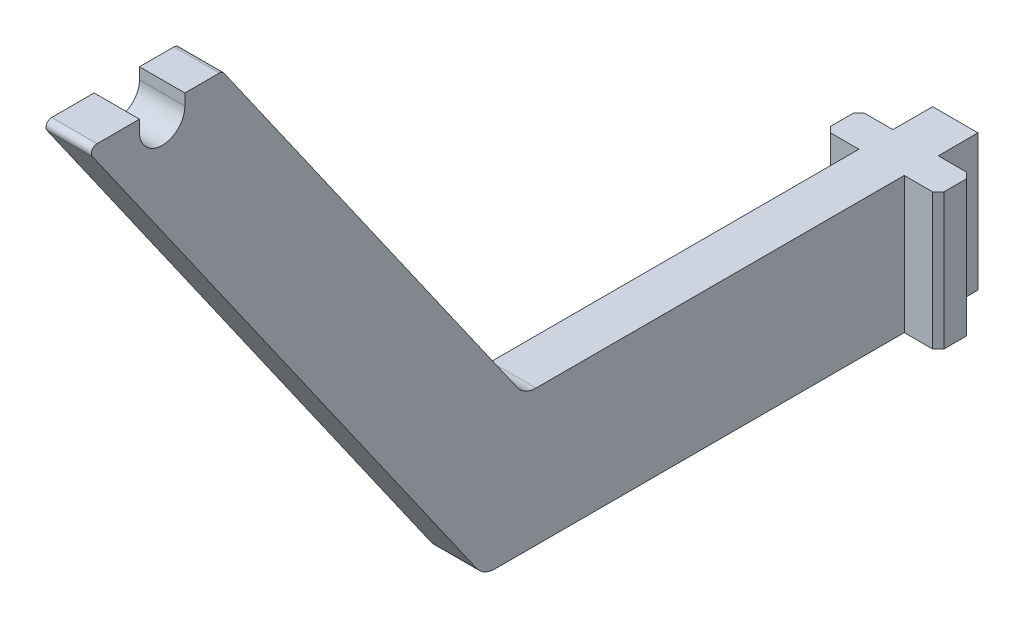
ISO-10303-21;
HEADER;
FILE_DESCRIPTION(('STEP AP214'),'2;1');
FILE_NAME('part.step','',(''),(''),'','','');
FILE_SCHEMA(('AUTOMOTIVE_DESIGN { 1 0 10303 214 1 1 1 1 }'));
ENDSEC;
DATA;
#1=APPLICATION_CONTEXT('core data for automotive mechanical design processes');
#2=APPLICATION_PROTOCOL_DEFINITION('international standard','automotive_design',2000,#1);
#3=PRODUCT_CONTEXT('',#1,'mechanical');
#4=PRODUCT('Part','Part','',(#3));
#5=PRODUCT_RELATED_PRODUCT_CATEGORY('part','',(#4));
#6=PRODUCT_DEFINITION_FORMATION('','',#4);
#7=PRODUCT_DEFINITION_CONTEXT('part definition',#1,'design');
#8=PRODUCT_DEFINITION('design','',#6,#7);
#9=PRODUCT_DEFINITION_SHAPE('','',#8);
#10=(LENGTH_UNIT() NAMED_UNIT(*) SI_UNIT(.MILLI.,.METRE.));
#11=(NAMED_UNIT(*) PLANE_ANGLE_UNIT() SI_UNIT($,.RADIAN.));
#12=(NAMED_UNIT(*) SI_UNIT($,.STERADIAN.) SOLID_ANGLE_UNIT());
#13=UNCERTAINTY_MEASURE_WITH_UNIT(LENGTH_MEASURE(1.E-05),#10,'distance_accuracy_value','');
#14=(GEOMETRIC_REPRESENTATION_CONTEXT(3) GLOBAL_UNCERTAINTY_ASSIGNED_CONTEXT((#13)) GLOBAL_UNIT_ASSIGNED_CONTEXT((#10,
#11,#12)) REPRESENTATION_CONTEXT('',''));
#15=CARTESIAN_POINT('',(0.,0.,0.));
#16=DIRECTION('',(0.,0.,1.));
#17=DIRECTION('',(1.,0.,0.));
#18=AXIS2_PLACEMENT_3D('',#15,#16,#17);
#19=CARTESIAN_POINT('',(1.,25.,39.3039432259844));
#20=DIRECTION('',(0.,-1.,0.));
#21=DIRECTION('',(0.,0.,-1.));
#22=AXIS2_PLACEMENT_3D('',#19,#20,#21);
#23=PLANE('',#22);
#24=DIRECTION('',(0.,0.,1.));
#25=VECTOR('',#24,1.);
#26=CARTESIAN_POINT('',(-1.,25.,39.3039432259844));
#27=LINE('',#26,#25);
#28=CARTESIAN_POINT('',(-1.,25.,36.9538394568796));
#29=VERTEX_POINT('',#28);
#30=CARTESIAN_POINT('',(-1.,25.,38.8236976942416));
#31=VERTEX_POINT('',#30);
#32=EDGE_CURVE('E223',#29,#31,#27,.T.);
#33=ORIENTED_EDGE('',*,*,#32,.T.);
#34=DIRECTION('',(-1.,0.,0.));
#35=VECTOR('',#34,1.);
#36=CARTESIAN_POINT('',(1.,25.,38.8236976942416));
#37=LINE('',#36,#35);
#38=CARTESIAN_POINT('',(1.,25.,38.8236976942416));
#39=VERTEX_POINT('',#38);
#40=EDGE_CURVE('E312',#31,#39,#37,.F.);
#41=ORIENTED_EDGE('',*,*,#40,.T.);
#42=DIRECTION('',(0.,0.,1.));
#43=VECTOR('',#42,1.);
#44=CARTESIAN_POINT('',(1.,25.,39.3039432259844));
#45=LINE('',#44,#43);
#46=CARTESIAN_POINT('',(1.,25.,36.9538394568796));
#47=VERTEX_POINT('',#46);
#48=EDGE_CURVE('E226',#47,#39,#45,.T.);
#49=ORIENTED_EDGE('',*,*,#48,.F.);
#50=DIRECTION('',(-1.,0.,0.));
#51=VECTOR('',#50,1.);
#52=CARTESIAN_POINT('',(2.500025,25.,36.9538394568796));
#53=LINE('',#52,#51);
#54=EDGE_CURVE('E210',#47,#29,#53,.T.);
#55=ORIENTED_EDGE('',*,*,#54,.T.);
#56=EDGE_LOOP('',(#33,#41,#49,#55));
#57=FACE_BOUND('',#56,.T.);
#58=ADVANCED_FACE('F35',(#57),#23,.F.);
#59=CARTESIAN_POINT('',(1.,0.,0.));
#60=DIRECTION('',(-1.,0.,0.));
#61=DIRECTION('',(0.,0.,1.));
#62=AXIS2_PLACEMENT_3D('',#59,#60,#61);
#63=PLANE('',#62);
#64=DIRECTION('',(0.,1.,0.));
#65=VECTOR('',#64,1.);
#66=CARTESIAN_POINT('',(1.,-2.12132034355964,1.75));
#67=LINE('',#66,#65);
#68=CARTESIAN_POINT('',(1.,0.,1.75));
#69=VERTEX_POINT('',#68);
#70=CARTESIAN_POINT('',(1.,6.,1.75));
#71=VERTEX_POINT('',#70);
#72=EDGE_CURVE('E334',#69,#71,#67,.T.);
#73=ORIENTED_EDGE('',*,*,#72,.F.);
#74=DIRECTION('',(0.,0.,-1.));
#75=VECTOR('',#74,1.);
#76=CARTESIAN_POINT('',(1.,0.,0.));
#77=LINE('',#76,#75);
#78=CARTESIAN_POINT('',(1.,0.,0.));
#79=VERTEX_POINT('',#78);
#80=EDGE_CURVE('E243',#69,#79,#77,.T.);
#81=ORIENTED_EDGE('',*,*,#80,.T.);
#82=DIRECTION('',(0.,1.,0.));
#83=VECTOR('',#82,1.);
#84=CARTESIAN_POINT('',(1.,0.,0.));
#85=LINE('',#84,#83);
#86=CARTESIAN_POINT('',(1.,6.,0.));
#87=VERTEX_POINT('',#86);
#88=EDGE_CURVE('E273',#79,#87,#85,.T.);
#89=ORIENTED_EDGE('',*,*,#88,.T.);
#90=DIRECTION('',(0.,0.,1.));
#91=VECTOR('',#90,1.);
#92=CARTESIAN_POINT('',(1.,6.,0.));
#93=LINE('',#92,#91);
#94=EDGE_CURVE('E288',#87,#71,#93,.T.);
#95=ORIENTED_EDGE('',*,*,#94,.T.);
#96=EDGE_LOOP('',(#73,#81,#89,#95));
#97=FACE_BOUND('',#96,.T.);
#98=ADVANCED_FACE('F480',(#97),#63,.F.);
#99=CARTESIAN_POINT('',(-1.,0.,0.));
#100=DIRECTION('',(-1.,0.,0.));
#101=DIRECTION('',(0.,0.,1.));
#102=AXIS2_PLACEMENT_3D('',#99,#100,#101);
#103=PLANE('',#102);
#104=DIRECTION('',(0.,0.,-1.));
#105=VECTOR('',#104,1.);
#106=CARTESIAN_POINT('',(-1.,0.,0.));
#107=LINE('',#106,#105);
#108=CARTESIAN_POINT('',(-1.,0.,1.75));
#109=VERTEX_POINT('',#108);
#110=CARTESIAN_POINT('',(-1.,0.,0.));
#111=VERTEX_POINT('',#110);
#112=EDGE_CURVE('E252',#109,#111,#107,.T.);
#113=ORIENTED_EDGE('',*,*,#112,.F.);
#114=DIRECTION('',(0.,1.,0.));
#115=VECTOR('',#114,1.);
#116=CARTESIAN_POINT('',(-1.,-2.12132034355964,1.75));
#117=LINE('',#116,#115);
#118=CARTESIAN_POINT('',(-1.,6.,1.75));
#119=VERTEX_POINT('',#118);
#120=EDGE_CURVE('E404',#109,#119,#117,.T.);
#121=ORIENTED_EDGE('',*,*,#120,.T.);
#122=DIRECTION('',(0.,0.,1.));
#123=VECTOR('',#122,1.);
#124=CARTESIAN_POINT('',(-1.,6.,0.));
#125=LINE('',#124,#123);
#126=CARTESIAN_POINT('',(-1.,6.,0.));
#127=VERTEX_POINT('',#126);
#128=EDGE_CURVE('E238',#127,#119,#125,.T.);
#129=ORIENTED_EDGE('',*,*,#128,.F.);
#130=DIRECTION('',(0.,1.,0.));
#131=VECTOR('',#130,1.);
#132=CARTESIAN_POINT('',(-1.,0.,0.));
#133=LINE('',#132,#131);
#134=EDGE_CURVE('E262',#111,#127,#133,.T.);
#135=ORIENTED_EDGE('',*,*,#134,.F.);
#136=EDGE_LOOP('',(#113,#121,#129,#135));
#137=FACE_BOUND('',#136,.T.);
#138=ADVANCED_FACE('F462',(#137),#103,.T.);
#139=CARTESIAN_POINT('',(1.,0.,0.));
#140=DIRECTION('',(0.,1.,0.));
#141=DIRECTION('',(0.,0.,1.));
#142=AXIS2_PLACEMENT_3D('',#139,#140,#141);
#143=PLANE('',#142);
#144=DIRECTION('',(-1.,0.,0.));
#145=VECTOR('',#144,1.);
#146=CARTESIAN_POINT('',(-2.5,0.,3.25));
#147=LINE('',#146,#145);
#148=CARTESIAN_POINT('',(-1.,0.,3.25));
#149=VERTEX_POINT('',#148);
#150=CARTESIAN_POINT('',(-2.25000000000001,0.,3.25));
#151=VERTEX_POINT('',#150);
#152=EDGE_CURVE('E398',#149,#151,#147,.T.);
#153=ORIENTED_EDGE('',*,*,#152,.T.);
#154=DIRECTION('',(0.707106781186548,0.,0.707106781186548));
#155=VECTOR('',#154,1.);
#156=CARTESIAN_POINT('',(-2.5,0.,3.00000000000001));
#157=LINE('',#156,#155);
#158=CARTESIAN_POINT('',(-2.5,0.,3.00000000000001));
#159=VERTEX_POINT('',#158);
#160=EDGE_CURVE('E365',#151,#159,#157,.F.);
#161=ORIENTED_EDGE('',*,*,#160,.T.);
#162=DIRECTION('',(0.,0.,-1.));
#163=VECTOR('',#162,1.);
#164=CARTESIAN_POINT('',(-2.5,0.,1.75));
#165=LINE('',#164,#163);
#166=CARTESIAN_POINT('',(-2.5,0.,2.));
#167=VERTEX_POINT('',#166);
#168=EDGE_CURVE('E395',#159,#167,#165,.T.);
#169=ORIENTED_EDGE('',*,*,#168,.T.);
#170=DIRECTION('',(-0.707106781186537,0.,0.707106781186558));
#171=VECTOR('',#170,1.);
#172=CARTESIAN_POINT('',(-2.25000000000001,0.,1.75));
#173=LINE('',#172,#171);
#174=CARTESIAN_POINT('',(-2.25000000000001,0.,1.75));
#175=VERTEX_POINT('',#174);
#176=EDGE_CURVE('E363',#167,#175,#173,.F.);
#177=ORIENTED_EDGE('',*,*,#176,.T.);
#178=DIRECTION('',(1.,0.,0.));
#179=VECTOR('',#178,1.);
#180=CARTESIAN_POINT('',(-1.,0.,1.75));
#181=LINE('',#180,#179);
#182=EDGE_CURVE('E256',#175,#109,#181,.T.);
#183=ORIENTED_EDGE('',*,*,#182,.T.);
#184=ORIENTED_EDGE('',*,*,#112,.T.);
#185=DIRECTION('',(-1.,0.,0.));
#186=VECTOR('',#185,1.);
#187=CARTESIAN_POINT('',(1.,0.,0.));
#188=LINE('',#187,#186);
#189=EDGE_CURVE('E247',#79,#111,#188,.T.);
#190=ORIENTED_EDGE('',*,*,#189,.F.);
#191=ORIENTED_EDGE('',*,*,#80,.F.);
#192=DIRECTION('',(1.,0.,0.));
#193=VECTOR('',#192,1.);
#194=CARTESIAN_POINT('',(1.,0.,1.75));
#195=LINE('',#194,#193);
#196=CARTESIAN_POINT('',(2.25,0.,1.75));
#197=VERTEX_POINT('',#196);
#198=EDGE_CURVE('E342',#69,#197,#195,.T.);
#199=ORIENTED_EDGE('',*,*,#198,.T.);
#200=DIRECTION('',(-0.707106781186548,0.,-0.707106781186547));
#201=VECTOR('',#200,1.);
#202=CARTESIAN_POINT('',(2.5,0.,2.));
#203=LINE('',#202,#201);
#204=CARTESIAN_POINT('',(2.5,0.,2.));
#205=VERTEX_POINT('',#204);
#206=EDGE_CURVE('E359',#197,#205,#203,.F.);
#207=ORIENTED_EDGE('',*,*,#206,.T.);
#208=DIRECTION('',(0.,0.,1.));
#209=VECTOR('',#208,1.);
#210=CARTESIAN_POINT('',(2.5,0.,1.75));
#211=LINE('',#210,#209);
#212=CARTESIAN_POINT('',(2.5,0.,3.));
#213=VERTEX_POINT('',#212);
#214=EDGE_CURVE('E356',#205,#213,#211,.T.);
#215=ORIENTED_EDGE('',*,*,#214,.T.);
#216=DIRECTION('',(0.707106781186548,0.,-0.707106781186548));
#217=VECTOR('',#216,1.);
#218=CARTESIAN_POINT('',(2.25,0.,3.25));
#219=LINE('',#218,#217);
#220=CARTESIAN_POINT('',(2.25,0.,3.25));
#221=VERTEX_POINT('',#220);
#222=EDGE_CURVE('E50',#213,#221,#219,.F.);
#223=ORIENTED_EDGE('',*,*,#222,.T.);
#224=DIRECTION('',(-1.,0.,0.));
#225=VECTOR('',#224,1.);
#226=CARTESIAN_POINT('',(2.5,0.,3.25));
#227=LINE('',#226,#225);
#228=CARTESIAN_POINT('',(1.,0.,3.25));
#229=VERTEX_POINT('',#228);
#230=EDGE_CURVE('E345',#221,#229,#227,.T.);
#231=ORIENTED_EDGE('',*,*,#230,.T.);
#232=CARTESIAN_POINT('',(1.,0.,21.27818772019));
#233=VERTEX_POINT('',#232);
#234=EDGE_CURVE('E269',#233,#229,#77,.T.);
#235=ORIENTED_EDGE('',*,*,#234,.F.);
#236=DIRECTION('',(-1.,0.,0.));
#237=VECTOR('',#236,1.);
#238=CARTESIAN_POINT('',(1.,0.,21.27818772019));
#239=LINE('',#238,#237);
#240=CARTESIAN_POINT('',(-1.,0.,21.27818772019));
#241=VERTEX_POINT('',#240);
#242=EDGE_CURVE('E274',#233,#241,#239,.T.);
#243=ORIENTED_EDGE('',*,*,#242,.T.);
#244=EDGE_CURVE('E255',#241,#149,#107,.T.);
#245=ORIENTED_EDGE('',*,*,#244,.T.);
#246=EDGE_LOOP('',(#153,#161,#169,#177,#183,#184,#190,#191,#199,#207,#215,#223,#231,#235,#243,#245));
#247=FACE_BOUND('',#246,.T.);
#248=ADVANCED_FACE('F439',(#247),#143,.F.);
#249=CARTESIAN_POINT('',(1.,0.,0.));
#250=DIRECTION('',(0.,0.,1.));
#251=DIRECTION('',(1.,0.,0.));
#252=AXIS2_PLACEMENT_3D('',#249,#250,#251);
#253=PLANE('',#252);
#254=ORIENTED_EDGE('',*,*,#134,.T.);
#255=DIRECTION('',(-1.,0.,0.));
#256=VECTOR('',#255,1.);
#257=CARTESIAN_POINT('',(1.,6.,0.));
#258=LINE('',#257,#256);
#259=EDGE_CURVE('E244',#87,#127,#258,.T.);
#260=ORIENTED_EDGE('',*,*,#259,.F.);
#261=ORIENTED_EDGE('',*,*,#88,.F.);
#262=ORIENTED_EDGE('',*,*,#189,.T.);
#263=EDGE_LOOP('',(#254,#260,#261,#262));
#264=FACE_BOUND('',#263,.T.);
#265=ADVANCED_FACE('F456',(#264),#253,.F.);
#266=CARTESIAN_POINT('',(1.,6.,0.));
#267=DIRECTION('',(0.,-1.,0.));
#268=DIRECTION('',(0.,0.,-1.));
#269=AXIS2_PLACEMENT_3D('',#266,#267,#268);
#270=PLANE('',#269);
#271=DIRECTION('',(0.,0.,1.));
#272=VECTOR('',#271,1.);
#273=CARTESIAN_POINT('',(-2.5,6.,1.75));
#274=LINE('',#273,#272);
#275=CARTESIAN_POINT('',(-2.5,6.,2.));
#276=VERTEX_POINT('',#275);
#277=CARTESIAN_POINT('',(-2.5,6.,3.00000000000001));
#278=VERTEX_POINT('',#277);
#279=EDGE_CURVE('E400',#276,#278,#274,.T.);
#280=ORIENTED_EDGE('',*,*,#279,.T.);
#281=DIRECTION('',(-0.707106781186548,0.,-0.707106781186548));
#282=VECTOR('',#281,1.);
#283=CARTESIAN_POINT('',(-2.5,6.,3.00000000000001));
#284=LINE('',#283,#282);
#285=CARTESIAN_POINT('',(-2.25000000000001,6.,3.25));
#286=VERTEX_POINT('',#285);
#287=EDGE_CURVE('E428',#278,#286,#284,.F.);
#288=ORIENTED_EDGE('',*,*,#287,.T.);
#289=DIRECTION('',(1.,0.,0.));
#290=VECTOR('',#289,1.);
#291=CARTESIAN_POINT('',(-2.5,6.,3.25));
#292=LINE('',#291,#290);
#293=CARTESIAN_POINT('',(-1.,6.,3.25));
#294=VERTEX_POINT('',#293);
#295=EDGE_CURVE('E336',#286,#294,#292,.T.);
#296=ORIENTED_EDGE('',*,*,#295,.T.);
#297=CARTESIAN_POINT('',(-1.,6.,19.4794329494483));
#298=VERTEX_POINT('',#297);
#299=EDGE_CURVE('E405',#294,#298,#125,.T.);
#300=ORIENTED_EDGE('',*,*,#299,.T.);
#301=DIRECTION('',(-1.,0.,0.));
#302=VECTOR('',#301,1.);
#303=CARTESIAN_POINT('',(1.,6.,19.4794329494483));
#304=LINE('',#303,#302);
#305=CARTESIAN_POINT('',(1.,6.,19.4794329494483));
#306=VERTEX_POINT('',#305);
#307=EDGE_CURVE('E267',#298,#306,#304,.F.);
#308=ORIENTED_EDGE('',*,*,#307,.T.);
#309=CARTESIAN_POINT('',(1.,6.,3.25));
#310=VERTEX_POINT('',#309);
#311=EDGE_CURVE('E292',#310,#306,#93,.T.);
#312=ORIENTED_EDGE('',*,*,#311,.F.);
#313=DIRECTION('',(1.,0.,0.));
#314=VECTOR('',#313,1.);
#315=CARTESIAN_POINT('',(2.5,6.,3.25));
#316=LINE('',#315,#314);
#317=CARTESIAN_POINT('',(2.25,6.,3.25));
#318=VERTEX_POINT('',#317);
#319=EDGE_CURVE('E386',#310,#318,#316,.T.);
#320=ORIENTED_EDGE('',*,*,#319,.T.);
#321=DIRECTION('',(-0.707106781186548,0.,0.707106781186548));
#322=VECTOR('',#321,1.);
#323=CARTESIAN_POINT('',(2.25,6.,3.25));
#324=LINE('',#323,#322);
#325=CARTESIAN_POINT('',(2.5,6.,3.));
#326=VERTEX_POINT('',#325);
#327=EDGE_CURVE('E385',#318,#326,#324,.F.);
#328=ORIENTED_EDGE('',*,*,#327,.T.);
#329=DIRECTION('',(0.,0.,-1.));
#330=VECTOR('',#329,1.);
#331=CARTESIAN_POINT('',(2.5,6.,1.75));
#332=LINE('',#331,#330);
#333=CARTESIAN_POINT('',(2.5,6.,2.));
#334=VERTEX_POINT('',#333);
#335=EDGE_CURVE('E335',#326,#334,#332,.T.);
#336=ORIENTED_EDGE('',*,*,#335,.T.);
#337=DIRECTION('',(0.707106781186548,0.,0.707106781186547));
#338=VECTOR('',#337,1.);
#339=CARTESIAN_POINT('',(2.5,6.,2.));
#340=LINE('',#339,#338);
#341=CARTESIAN_POINT('',(2.25,6.,1.75));
#342=VERTEX_POINT('',#341);
#343=EDGE_CURVE('E330',#334,#342,#340,.F.);
#344=ORIENTED_EDGE('',*,*,#343,.T.);
#345=DIRECTION('',(-1.,0.,0.));
#346=VECTOR('',#345,1.);
#347=CARTESIAN_POINT('',(1.,6.,1.75));
#348=LINE('',#347,#346);
#349=EDGE_CURVE('E331',#342,#71,#348,.T.);
#350=ORIENTED_EDGE('',*,*,#349,.T.);
#351=ORIENTED_EDGE('',*,*,#94,.F.);
#352=ORIENTED_EDGE('',*,*,#259,.T.);
#353=ORIENTED_EDGE('',*,*,#128,.T.);
#354=DIRECTION('',(-1.,0.,0.));
#355=VECTOR('',#354,1.);
#356=CARTESIAN_POINT('',(-1.,6.,1.75));
#357=LINE('',#356,#355);
#358=CARTESIAN_POINT('',(-2.25000000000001,6.,1.75));
#359=VERTEX_POINT('',#358);
#360=EDGE_CURVE('E394',#119,#359,#357,.T.);
#361=ORIENTED_EDGE('',*,*,#360,.T.);
#362=DIRECTION('',(0.707106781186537,0.,-0.707106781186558));
#363=VECTOR('',#362,1.);
#364=CARTESIAN_POINT('',(-2.25000000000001,6.,1.75));
#365=LINE('',#364,#363);
#366=EDGE_CURVE('E416',#359,#276,#365,.F.);
#367=ORIENTED_EDGE('',*,*,#366,.T.);
#368=EDGE_LOOP('',(#280,#288,#296,#300,#308,#312,#320,#328,#336,#344,#350,#351,#352,#353,#361,#367));
#369=FACE_BOUND('',#368,.T.);
#370=ADVANCED_FACE('F382',(#369),#270,.F.);
#371=CARTESIAN_POINT('',(1.,6.,20.));
#372=DIRECTION('',(0.,-0.573576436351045,0.819152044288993));
#373=DIRECTION('',(0.,-0.819152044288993,-0.573576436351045));
#374=AXIS2_PLACEMENT_3D('',#371,#372,#373);
#375=PLANE('',#374);
#376=DIRECTION('',(0.,0.819152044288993,0.573576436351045));
#377=VECTOR('',#376,1.);
#378=CARTESIAN_POINT('',(-1.,6.,20.));
#379=LINE('',#378,#377);
#380=CARTESIAN_POINT('',(-1.,6.42642356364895,20.2985849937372));
#381=VERTEX_POINT('',#380);
#382=CARTESIAN_POINT('',(-1.,24.8933941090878,33.2292969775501));
#383=VERTEX_POINT('',#382);
#384=EDGE_CURVE('E234',#381,#383,#379,.T.);
#385=ORIENTED_EDGE('',*,*,#384,.T.);
#386=DIRECTION('',(-1.,0.,0.));
#387=VECTOR('',#386,1.);
#388=CARTESIAN_POINT('',(1.,24.8933941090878,33.2292969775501));
#389=LINE('',#388,#387);
#390=CARTESIAN_POINT('',(1.,24.8933941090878,33.2292969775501));
#391=VERTEX_POINT('',#390);
#392=EDGE_CURVE('E319',#383,#391,#389,.F.);
#393=ORIENTED_EDGE('',*,*,#392,.T.);
#394=DIRECTION('',(0.,0.819152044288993,0.573576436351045));
#395=VECTOR('',#394,1.);
#396=CARTESIAN_POINT('',(1.,6.,20.));
#397=LINE('',#396,#395);
#398=CARTESIAN_POINT('',(1.,6.42642356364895,20.2985849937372));
#399=VERTEX_POINT('',#398);
#400=EDGE_CURVE('E291',#399,#391,#397,.T.);
#401=ORIENTED_EDGE('',*,*,#400,.F.);
#402=DIRECTION('',(-1.,0.,0.));
#403=VECTOR('',#402,1.);
#404=CARTESIAN_POINT('',(-1.,6.42642356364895,20.2985849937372));
#405=LINE('',#404,#403);
#406=EDGE_CURVE('E251',#399,#381,#405,.T.);
#407=ORIENTED_EDGE('',*,*,#406,.T.);
#408=EDGE_LOOP('',(#385,#393,#401,#407));
#409=FACE_BOUND('',#408,.T.);
#410=ADVANCED_FACE('F497',(#409),#375,.F.);
#411=CARTESIAN_POINT('',(1.,25.,33.4340849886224));
#412=VERTEX_POINT('',#411);
#413=CARTESIAN_POINT('',(1.,25.,34.9538394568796));
#414=VERTEX_POINT('',#413);
#415=EDGE_CURVE('E298',#412,#414,#45,.T.);
#416=ORIENTED_EDGE('',*,*,#415,.F.);
#417=DIRECTION('',(-1.,0.,0.));
#418=VECTOR('',#417,1.);
#419=CARTESIAN_POINT('',(1.,25.,33.4340849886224));
#420=LINE('',#419,#418);
#421=CARTESIAN_POINT('',(-1.,25.,33.4340849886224));
#422=VERTEX_POINT('',#421);
#423=EDGE_CURVE('E315',#412,#422,#420,.T.);
#424=ORIENTED_EDGE('',*,*,#423,.T.);
#425=CARTESIAN_POINT('',(-1.,25.,34.9538394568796));
#426=VERTEX_POINT('',#425);
#427=EDGE_CURVE('E233',#422,#426,#27,.T.);
#428=ORIENTED_EDGE('',*,*,#427,.T.);
#429=DIRECTION('',(-1.,0.,0.));
#430=VECTOR('',#429,1.);
#431=CARTESIAN_POINT('',(2.500025,25.,34.9538394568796));
#432=LINE('',#431,#430);
#433=EDGE_CURVE('E227',#414,#426,#432,.T.);
#434=ORIENTED_EDGE('',*,*,#433,.F.);
#435=EDGE_LOOP('',(#416,#424,#428,#434));
#436=FACE_BOUND('',#435,.T.);
#437=ADVANCED_FACE('F517',(#436),#23,.F.);
#438=CARTESIAN_POINT('',(1.,0.,21.7987547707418));
#439=DIRECTION('',(0.,0.573576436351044,-0.819152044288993));
#440=DIRECTION('',(0.,0.819152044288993,0.573576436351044));
#441=AXIS2_PLACEMENT_3D('',#438,#439,#440);
#442=PLANE('',#441);
#443=DIRECTION('',(0.,-0.819152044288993,-0.573576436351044));
#444=VECTOR('',#443,1.);
#445=CARTESIAN_POINT('',(1.,0.,21.7987547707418));
#446=LINE('',#445,#444);
#447=CARTESIAN_POINT('',(1.,24.6066058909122,39.0284857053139));
#448=VERTEX_POINT('',#447);
#449=CARTESIAN_POINT('',(1.,0.426423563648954,22.097339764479));
#450=VERTEX_POINT('',#449);
#451=EDGE_CURVE('E248',#448,#450,#446,.T.);
#452=ORIENTED_EDGE('',*,*,#451,.F.);
#453=DIRECTION('',(-1.,0.,0.));
#454=VECTOR('',#453,1.);
#455=CARTESIAN_POINT('',(1.,24.6066058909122,39.0284857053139));
#456=LINE('',#455,#454);
#457=CARTESIAN_POINT('',(-1.,24.6066058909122,39.0284857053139));
#458=VERTEX_POINT('',#457);
#459=EDGE_CURVE('E314',#448,#458,#456,.T.);
#460=ORIENTED_EDGE('',*,*,#459,.T.);
#461=DIRECTION('',(0.,-0.819152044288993,-0.573576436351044));
#462=VECTOR('',#461,1.);
#463=CARTESIAN_POINT('',(-1.,0.,21.7987547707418));
#464=LINE('',#463,#462);
#465=CARTESIAN_POINT('',(-1.,0.426423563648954,22.097339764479));
#466=VERTEX_POINT('',#465);
#467=EDGE_CURVE('E236',#458,#466,#464,.T.);
#468=ORIENTED_EDGE('',*,*,#467,.T.);
#469=DIRECTION('',(-1.,0.,0.));
#470=VECTOR('',#469,1.);
#471=CARTESIAN_POINT('',(1.,0.426423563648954,22.097339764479));
#472=LINE('',#471,#470);
#473=EDGE_CURVE('E490',#466,#450,#472,.F.);
#474=ORIENTED_EDGE('',*,*,#473,.T.);
#475=EDGE_LOOP('',(#452,#460,#468,#474));
#476=FACE_BOUND('',#475,.T.);
#477=ADVANCED_FACE('F515',(#476),#442,.F.);
#478=ORIENTED_EDGE('',*,*,#48,.T.);
#479=CARTESIAN_POINT('',(1.,24.75,38.8236976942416));
#480=DIRECTION('',(-1.,0.,0.));
#481=DIRECTION('',(0.,0.,1.));
#482=AXIS2_PLACEMENT_3D('',#479,#480,#481);
#483=CIRCLE('',#482,0.25);
#484=EDGE_CURVE('E305',#39,#448,#483,.F.);
#485=ORIENTED_EDGE('',*,*,#484,.T.);
#486=ORIENTED_EDGE('',*,*,#451,.T.);
#487=CARTESIAN_POINT('',(1.,0.999999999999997,21.27818772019));
#488=DIRECTION('',(-1.,0.,0.));
#489=DIRECTION('',(0.,0.,1.));
#490=AXIS2_PLACEMENT_3D('',#487,#488,#489);
#491=CIRCLE('',#490,1.);
#492=EDGE_CURVE('E483',#450,#233,#491,.F.);
#493=ORIENTED_EDGE('',*,*,#492,.T.);
#494=ORIENTED_EDGE('',*,*,#234,.T.);
#495=DIRECTION('',(0.,1.,0.));
#496=VECTOR('',#495,1.);
#497=CARTESIAN_POINT('',(1.,-2.12132034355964,3.25));
#498=LINE('',#497,#496);
#499=EDGE_CURVE('E346',#229,#310,#498,.T.);
#500=ORIENTED_EDGE('',*,*,#499,.T.);
#501=ORIENTED_EDGE('',*,*,#311,.T.);
#502=CARTESIAN_POINT('',(1.,7.,19.4794329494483));
#503=DIRECTION('',(-1.,0.,0.));
#504=DIRECTION('',(0.,0.,1.));
#505=AXIS2_PLACEMENT_3D('',#502,#503,#504);
#506=CIRCLE('',#505,1.);
#507=EDGE_CURVE('E507',#306,#399,#506,.T.);
#508=ORIENTED_EDGE('',*,*,#507,.T.);
#509=ORIENTED_EDGE('',*,*,#400,.T.);
#510=CARTESIAN_POINT('',(1.,24.75,33.4340849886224));
#511=DIRECTION('',(-1.,0.,0.));
#512=DIRECTION('',(0.,0.,1.));
#513=AXIS2_PLACEMENT_3D('',#510,#511,#512);
#514=CIRCLE('',#513,0.25);
#515=EDGE_CURVE('E316',#391,#412,#514,.F.);
#516=ORIENTED_EDGE('',*,*,#515,.T.);
#517=ORIENTED_EDGE('',*,*,#415,.T.);
#518=DIRECTION('',(0.,-1.,0.));
#519=VECTOR('',#518,1.);
#520=CARTESIAN_POINT('',(1.,0.,34.9538394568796));
#521=LINE('',#520,#519);
#522=CARTESIAN_POINT('',(1.,24.5,34.9538394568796));
#523=VERTEX_POINT('',#522);
#524=EDGE_CURVE('E765',#414,#523,#521,.T.);
#525=ORIENTED_EDGE('',*,*,#524,.T.);
#526=CARTESIAN_POINT('',(1.,24.5,35.9538394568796));
#527=DIRECTION('',(-1.,0.,0.));
#528=DIRECTION('',(0.,0.,1.));
#529=AXIS2_PLACEMENT_3D('',#526,#527,#528);
#530=CIRCLE('',#529,1.);
#531=CARTESIAN_POINT('',(1.,24.5,36.9538394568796));
#532=VERTEX_POINT('',#531);
#533=EDGE_CURVE('E758',#523,#532,#530,.T.);
#534=ORIENTED_EDGE('',*,*,#533,.T.);
#535=DIRECTION('',(0.,1.,0.));
#536=VECTOR('',#535,1.);
#537=CARTESIAN_POINT('',(1.,-5.12837542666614E-13,36.9538394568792));
#538=LINE('',#537,#536);
#539=EDGE_CURVE('E308',#532,#47,#538,.T.);
#540=ORIENTED_EDGE('',*,*,#539,.T.);
#541=EDGE_LOOP('',(#478,#485,#486,#493,#494,#500,#501,#508,#509,#516,#517,#525,#534,#540));
#542=FACE_BOUND('',#541,.T.);
#543=ADVANCED_FACE('F304',(#542),#63,.F.);
#544=ORIENTED_EDGE('',*,*,#467,.F.);
#545=CARTESIAN_POINT('',(-1.,24.75,38.8236976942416));
#546=DIRECTION('',(-1.,0.,0.));
#547=DIRECTION('',(0.,0.,1.));
#548=AXIS2_PLACEMENT_3D('',#545,#546,#547);
#549=CIRCLE('',#548,0.25);
#550=EDGE_CURVE('E232',#458,#31,#549,.T.);
#551=ORIENTED_EDGE('',*,*,#550,.T.);
#552=ORIENTED_EDGE('',*,*,#32,.F.);
#553=DIRECTION('',(0.,1.,0.));
#554=VECTOR('',#553,1.);
#555=CARTESIAN_POINT('',(-1.,25.,36.9538394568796));
#556=LINE('',#555,#554);
#557=CARTESIAN_POINT('',(-1.,24.5,36.9538394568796));
#558=VERTEX_POINT('',#557);
#559=EDGE_CURVE('E207',#558,#29,#556,.T.);
#560=ORIENTED_EDGE('',*,*,#559,.F.);
#561=CARTESIAN_POINT('',(-1.,24.5,35.9538394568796));
#562=DIRECTION('',(-1.,0.,0.));
#563=DIRECTION('',(0.,0.,1.));
#564=AXIS2_PLACEMENT_3D('',#561,#562,#563);
#565=CIRCLE('',#564,1.);
#566=CARTESIAN_POINT('',(-1.,24.5,34.9538394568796));
#567=VERTEX_POINT('',#566);
#568=EDGE_CURVE('E228',#567,#558,#565,.T.);
#569=ORIENTED_EDGE('',*,*,#568,.F.);
#570=DIRECTION('',(0.,-1.,0.));
#571=VECTOR('',#570,1.);
#572=CARTESIAN_POINT('',(-1.,24.5,34.9538394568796));
#573=LINE('',#572,#571);
#574=EDGE_CURVE('E218',#426,#567,#573,.T.);
#575=ORIENTED_EDGE('',*,*,#574,.F.);
#576=ORIENTED_EDGE('',*,*,#427,.F.);
#577=CARTESIAN_POINT('',(-1.,24.75,33.4340849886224));
#578=DIRECTION('',(-1.,0.,0.));
#579=DIRECTION('',(0.,0.,1.));
#580=AXIS2_PLACEMENT_3D('',#577,#578,#579);
#581=CIRCLE('',#580,0.25);
#582=EDGE_CURVE('E501',#422,#383,#581,.T.);
#583=ORIENTED_EDGE('',*,*,#582,.T.);
#584=ORIENTED_EDGE('',*,*,#384,.F.);
#585=CARTESIAN_POINT('',(-1.,7.,19.4794329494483));
#586=DIRECTION('',(-1.,0.,0.));
#587=DIRECTION('',(0.,0.,1.));
#588=AXIS2_PLACEMENT_3D('',#585,#586,#587);
#589=CIRCLE('',#588,1.);
#590=EDGE_CURVE('E452',#381,#298,#589,.F.);
#591=ORIENTED_EDGE('',*,*,#590,.T.);
#592=ORIENTED_EDGE('',*,*,#299,.F.);
#593=DIRECTION('',(0.,1.,0.));
#594=VECTOR('',#593,1.);
#595=CARTESIAN_POINT('',(-1.,-2.12132034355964,3.25));
#596=LINE('',#595,#594);
#597=EDGE_CURVE('E399',#149,#294,#596,.T.);
#598=ORIENTED_EDGE('',*,*,#597,.F.);
#599=ORIENTED_EDGE('',*,*,#244,.F.);
#600=CARTESIAN_POINT('',(-1.,0.999999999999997,21.27818772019));
#601=DIRECTION('',(-1.,0.,0.));
#602=DIRECTION('',(0.,0.,1.));
#603=AXIS2_PLACEMENT_3D('',#600,#601,#602);
#604=CIRCLE('',#603,1.);
#605=EDGE_CURVE('E489',#241,#466,#604,.T.);
#606=ORIENTED_EDGE('',*,*,#605,.T.);
#607=EDGE_LOOP('',(#544,#551,#552,#560,#569,#575,#576,#583,#584,#591,#592,#598,#599,#606));
#608=FACE_BOUND('',#607,.T.);
#609=ADVANCED_FACE('F231',(#608),#103,.T.);
#610=CARTESIAN_POINT('',(-2.5,-2.12132034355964,3.25));
#611=DIRECTION('',(0.,0.,1.));
#612=DIRECTION('',(0.,-1.,0.));
#613=AXIS2_PLACEMENT_3D('',#610,#611,#612);
#614=PLANE('',#613);
#615=ORIENTED_EDGE('',*,*,#295,.F.);
#616=DIRECTION('',(0.,-1.,0.));
#617=VECTOR('',#616,1.);
#618=CARTESIAN_POINT('',(-2.25000000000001,-2.12132034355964,3.25));
#619=LINE('',#618,#617);
#620=EDGE_CURVE('E361',#286,#151,#619,.T.);
#621=ORIENTED_EDGE('',*,*,#620,.T.);
#622=ORIENTED_EDGE('',*,*,#152,.F.);
#623=ORIENTED_EDGE('',*,*,#597,.T.);
#624=EDGE_LOOP('',(#615,#621,#622,#623));
#625=FACE_BOUND('',#624,.T.);
#626=ADVANCED_FACE('F436',(#625),#614,.T.);
#627=CARTESIAN_POINT('',(-2.5,-2.12132034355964,1.75));
#628=DIRECTION('',(-1.,0.,0.));
#629=DIRECTION('',(0.,0.,1.));
#630=AXIS2_PLACEMENT_3D('',#627,#628,#629);
#631=PLANE('',#630);
#632=ORIENTED_EDGE('',*,*,#168,.F.);
#633=DIRECTION('',(0.,1.,0.));
#634=VECTOR('',#633,1.);
#635=CARTESIAN_POINT('',(-2.5,-2.12132034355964,3.00000000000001));
#636=LINE('',#635,#634);
#637=EDGE_CURVE('E327',#159,#278,#636,.T.);
#638=ORIENTED_EDGE('',*,*,#637,.T.);
#639=ORIENTED_EDGE('',*,*,#279,.F.);
#640=DIRECTION('',(0.,-1.,0.));
#641=VECTOR('',#640,1.);
#642=CARTESIAN_POINT('',(-2.5,-2.12132034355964,2.));
#643=LINE('',#642,#641);
#644=EDGE_CURVE('E325',#276,#167,#643,.T.);
#645=ORIENTED_EDGE('',*,*,#644,.T.);
#646=EDGE_LOOP('',(#632,#638,#639,#645));
#647=FACE_BOUND('',#646,.T.);
#648=ADVANCED_FACE('F447',(#647),#631,.T.);
#649=CARTESIAN_POINT('',(-1.,-2.12132034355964,1.75));
#650=DIRECTION('',(0.,0.,-1.));
#651=DIRECTION('',(-1.,0.,0.));
#652=AXIS2_PLACEMENT_3D('',#649,#650,#651);
#653=PLANE('',#652);
#654=ORIENTED_EDGE('',*,*,#182,.F.);
#655=DIRECTION('',(0.,1.,0.));
#656=VECTOR('',#655,1.);
#657=CARTESIAN_POINT('',(-2.25000000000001,-2.12132034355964,1.75));
#658=LINE('',#657,#656);
#659=EDGE_CURVE('E367',#175,#359,#658,.T.);
#660=ORIENTED_EDGE('',*,*,#659,.T.);
#661=ORIENTED_EDGE('',*,*,#360,.F.);
#662=ORIENTED_EDGE('',*,*,#120,.F.);
#663=EDGE_LOOP('',(#654,#660,#661,#662));
#664=FACE_BOUND('',#663,.T.);
#665=ADVANCED_FACE('F422',(#664),#653,.T.);
#666=CARTESIAN_POINT('',(2.5,-2.12132034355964,3.25));
#667=DIRECTION('',(0.,0.,1.));
#668=DIRECTION('',(0.,-1.,0.));
#669=AXIS2_PLACEMENT_3D('',#666,#667,#668);
#670=PLANE('',#669);
#671=ORIENTED_EDGE('',*,*,#230,.F.);
#672=DIRECTION('',(0.,1.,0.));
#673=VECTOR('',#672,1.);
#674=CARTESIAN_POINT('',(2.25,-2.12132034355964,3.25));
#675=LINE('',#674,#673);
#676=EDGE_CURVE('E370',#221,#318,#675,.T.);
#677=ORIENTED_EDGE('',*,*,#676,.T.);
#678=ORIENTED_EDGE('',*,*,#319,.F.);
#679=ORIENTED_EDGE('',*,*,#499,.F.);
#680=EDGE_LOOP('',(#671,#677,#678,#679));
#681=FACE_BOUND('',#680,.T.);
#682=ADVANCED_FACE('F475',(#681),#670,.T.);
#683=CARTESIAN_POINT('',(1.,-2.12132034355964,1.75));
#684=DIRECTION('',(0.,0.,-1.));
#685=DIRECTION('',(0.,1.,0.));
#686=AXIS2_PLACEMENT_3D('',#683,#684,#685);
#687=PLANE('',#686);
#688=ORIENTED_EDGE('',*,*,#349,.F.);
#689=DIRECTION('',(0.,-1.,0.));
#690=VECTOR('',#689,1.);
#691=CARTESIAN_POINT('',(2.25,-2.12132034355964,1.75));
#692=LINE('',#691,#690);
#693=EDGE_CURVE('E11',#342,#197,#692,.T.);
#694=ORIENTED_EDGE('',*,*,#693,.T.);
#695=ORIENTED_EDGE('',*,*,#198,.F.);
#696=ORIENTED_EDGE('',*,*,#72,.T.);
#697=EDGE_LOOP('',(#688,#694,#695,#696));
#698=FACE_BOUND('',#697,.T.);
#699=ADVANCED_FACE('F468',(#698),#687,.T.);
#700=CARTESIAN_POINT('',(2.5,-2.12132034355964,1.75));
#701=DIRECTION('',(1.,0.,0.));
#702=DIRECTION('',(0.,0.,-1.));
#703=AXIS2_PLACEMENT_3D('',#700,#701,#702);
#704=PLANE('',#703);
#705=ORIENTED_EDGE('',*,*,#335,.F.);
#706=DIRECTION('',(0.,-1.,0.));
#707=VECTOR('',#706,1.);
#708=CARTESIAN_POINT('',(2.5,-2.12132034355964,3.));
#709=LINE('',#708,#707);
#710=EDGE_CURVE('E43',#326,#213,#709,.T.);
#711=ORIENTED_EDGE('',*,*,#710,.T.);
#712=ORIENTED_EDGE('',*,*,#214,.F.);
#713=DIRECTION('',(0.,1.,0.));
#714=VECTOR('',#713,1.);
#715=CARTESIAN_POINT('',(2.5,-2.12132034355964,2.));
#716=LINE('',#715,#714);
#717=EDGE_CURVE('E373',#205,#334,#716,.T.);
#718=ORIENTED_EDGE('',*,*,#717,.T.);
#719=EDGE_LOOP('',(#705,#711,#712,#718));
#720=FACE_BOUND('',#719,.T.);
#721=ADVANCED_FACE('F377',(#720),#704,.T.);
#722=CARTESIAN_POINT('',(2.500025,25.,36.9538394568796));
#723=DIRECTION('',(0.,0.,1.));
#724=DIRECTION('',(0.,-1.,0.));
#725=AXIS2_PLACEMENT_3D('',#722,#723,#724);
#726=PLANE('',#725);
#727=DIRECTION('',(-1.,0.,0.));
#728=VECTOR('',#727,1.);
#729=CARTESIAN_POINT('',(2.500025,24.5,36.9538394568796));
#730=LINE('',#729,#728);
#731=EDGE_CURVE('E213',#532,#558,#730,.T.);
#732=ORIENTED_EDGE('',*,*,#731,.T.);
#733=ORIENTED_EDGE('',*,*,#559,.T.);
#734=ORIENTED_EDGE('',*,*,#54,.F.);
#735=ORIENTED_EDGE('',*,*,#539,.F.);
#736=EDGE_LOOP('',(#732,#733,#734,#735));
#737=FACE_BOUND('',#736,.T.);
#738=ADVANCED_FACE('F209',(#737),#726,.F.);
#739=CARTESIAN_POINT('',(2.500025,24.5,35.9538394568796));
#740=DIRECTION('',(-1.,0.,0.));
#741=DIRECTION('',(0.,0.,1.));
#742=AXIS2_PLACEMENT_3D('',#739,#740,#741);
#743=CYLINDRICAL_SURFACE('',#742,1.);
#744=DIRECTION('',(-1.,0.,0.));
#745=VECTOR('',#744,1.);
#746=CARTESIAN_POINT('',(2.500025,24.5,34.9538394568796));
#747=LINE('',#746,#745);
#748=EDGE_CURVE('E756',#523,#567,#747,.T.);
#749=ORIENTED_EDGE('',*,*,#748,.T.);
#750=ORIENTED_EDGE('',*,*,#568,.T.);
#751=ORIENTED_EDGE('',*,*,#731,.F.);
#752=ORIENTED_EDGE('',*,*,#533,.F.);
#753=EDGE_LOOP('',(#749,#750,#751,#752));
#754=FACE_BOUND('',#753,.T.);
#755=ADVANCED_FACE('F709',(#754),#743,.F.);
#756=CARTESIAN_POINT('',(2.500025,24.5,34.9538394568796));
#757=DIRECTION('',(0.,0.,-1.));
#758=DIRECTION('',(-1.,0.,0.));
#759=AXIS2_PLACEMENT_3D('',#756,#757,#758);
#760=PLANE('',#759);
#761=ORIENTED_EDGE('',*,*,#433,.T.);
#762=ORIENTED_EDGE('',*,*,#574,.T.);
#763=ORIENTED_EDGE('',*,*,#748,.F.);
#764=ORIENTED_EDGE('',*,*,#524,.F.);
#765=EDGE_LOOP('',(#761,#762,#763,#764));
#766=FACE_BOUND('',#765,.T.);
#767=ADVANCED_FACE('F543',(#766),#760,.F.);
#768=CARTESIAN_POINT('',(1.,7.,19.4794329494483));
#769=DIRECTION('',(1.,0.,0.));
#770=DIRECTION('',(0.,0.,-1.));
#771=AXIS2_PLACEMENT_3D('',#768,#769,#770);
#772=CYLINDRICAL_SURFACE('',#771,1.);
#773=ORIENTED_EDGE('',*,*,#507,.F.);
#774=ORIENTED_EDGE('',*,*,#307,.F.);
#775=ORIENTED_EDGE('',*,*,#590,.F.);
#776=ORIENTED_EDGE('',*,*,#406,.F.);
#777=EDGE_LOOP('',(#773,#774,#775,#776));
#778=FACE_BOUND('',#777,.T.);
#779=ADVANCED_FACE('F540',(#778),#772,.F.);
#780=CARTESIAN_POINT('',(1.,0.999999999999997,21.27818772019));
#781=DIRECTION('',(-1.,0.,0.));
#782=DIRECTION('',(0.,0.,1.));
#783=AXIS2_PLACEMENT_3D('',#780,#781,#782);
#784=CYLINDRICAL_SURFACE('',#783,1.);
#785=ORIENTED_EDGE('',*,*,#492,.F.);
#786=ORIENTED_EDGE('',*,*,#473,.F.);
#787=ORIENTED_EDGE('',*,*,#605,.F.);
#788=ORIENTED_EDGE('',*,*,#242,.F.);
#789=EDGE_LOOP('',(#785,#786,#787,#788));
#790=FACE_BOUND('',#789,.T.);
#791=ADVANCED_FACE('F486',(#790),#784,.T.);
#792=CARTESIAN_POINT('',(1.,24.75,38.8236976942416));
#793=DIRECTION('',(-1.,0.,0.));
#794=DIRECTION('',(0.,0.,1.));
#795=AXIS2_PLACEMENT_3D('',#792,#793,#794);
#796=CYLINDRICAL_SURFACE('',#795,0.25);
#797=ORIENTED_EDGE('',*,*,#484,.F.);
#798=ORIENTED_EDGE('',*,*,#40,.F.);
#799=ORIENTED_EDGE('',*,*,#550,.F.);
#800=ORIENTED_EDGE('',*,*,#459,.F.);
#801=EDGE_LOOP('',(#797,#798,#799,#800));
#802=FACE_BOUND('',#801,.T.);
#803=ADVANCED_FACE('F311',(#802),#796,.T.);
#804=CARTESIAN_POINT('',(1.,24.75,33.4340849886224));
#805=DIRECTION('',(-1.,0.,0.));
#806=DIRECTION('',(0.,0.,1.));
#807=AXIS2_PLACEMENT_3D('',#804,#805,#806);
#808=CYLINDRICAL_SURFACE('',#807,0.25);
#809=ORIENTED_EDGE('',*,*,#515,.F.);
#810=ORIENTED_EDGE('',*,*,#392,.F.);
#811=ORIENTED_EDGE('',*,*,#582,.F.);
#812=ORIENTED_EDGE('',*,*,#423,.F.);
#813=EDGE_LOOP('',(#809,#810,#811,#812));
#814=FACE_BOUND('',#813,.T.);
#815=ADVANCED_FACE('F548',(#814),#808,.T.);
#816=CARTESIAN_POINT('',(-2.5,-2.12132034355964,3.00000000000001));
#817=DIRECTION('',(0.707106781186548,0.,-0.707106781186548));
#818=DIRECTION('',(0.,1.,0.));
#819=AXIS2_PLACEMENT_3D('',#816,#817,#818);
#820=PLANE('',#819);
#821=ORIENTED_EDGE('',*,*,#160,.F.);
#822=ORIENTED_EDGE('',*,*,#620,.F.);
#823=ORIENTED_EDGE('',*,*,#287,.F.);
#824=ORIENTED_EDGE('',*,*,#637,.F.);
#825=EDGE_LOOP('',(#821,#822,#823,#824));
#826=FACE_BOUND('',#825,.T.);
#827=ADVANCED_FACE('F445',(#826),#820,.F.);
#828=CARTESIAN_POINT('',(-2.25000000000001,-2.12132034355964,1.75));
#829=DIRECTION('',(0.707106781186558,0.,0.707106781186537));
#830=DIRECTION('',(0.,1.,0.));
#831=AXIS2_PLACEMENT_3D('',#828,#829,#830);
#832=PLANE('',#831);
#833=ORIENTED_EDGE('',*,*,#176,.F.);
#834=ORIENTED_EDGE('',*,*,#644,.F.);
#835=ORIENTED_EDGE('',*,*,#366,.F.);
#836=ORIENTED_EDGE('',*,*,#659,.F.);
#837=EDGE_LOOP('',(#833,#834,#835,#836));
#838=FACE_BOUND('',#837,.T.);
#839=ADVANCED_FACE('F426',(#838),#832,.F.);
#840=CARTESIAN_POINT('',(2.25,-2.12132034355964,3.25));
#841=DIRECTION('',(-0.707106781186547,0.,-0.707106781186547));
#842=DIRECTION('',(0.,1.,0.));
#843=AXIS2_PLACEMENT_3D('',#840,#841,#842);
#844=PLANE('',#843);
#845=ORIENTED_EDGE('',*,*,#222,.F.);
#846=ORIENTED_EDGE('',*,*,#710,.F.);
#847=ORIENTED_EDGE('',*,*,#327,.F.);
#848=ORIENTED_EDGE('',*,*,#676,.F.);
#849=EDGE_LOOP('',(#845,#846,#847,#848));
#850=FACE_BOUND('',#849,.T.);
#851=ADVANCED_FACE('F472',(#850),#844,.F.);
#852=CARTESIAN_POINT('',(2.5,-2.12132034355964,2.));
#853=DIRECTION('',(-0.707106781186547,0.,0.707106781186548));
#854=DIRECTION('',(0.,1.,0.));
#855=AXIS2_PLACEMENT_3D('',#852,#853,#854);
#856=PLANE('',#855);
#857=ORIENTED_EDGE('',*,*,#206,.F.);
#858=ORIENTED_EDGE('',*,*,#693,.F.);
#859=ORIENTED_EDGE('',*,*,#343,.F.);
#860=ORIENTED_EDGE('',*,*,#717,.F.);
#861=EDGE_LOOP('',(#857,#858,#859,#860));
#862=FACE_BOUND('',#861,.T.);
#863=ADVANCED_FACE('F37',(#862),#856,.F.);
#864=CLOSED_SHELL('',(#58,#98,#138,#248,#265,#370,#410,#437,#477,#543,#609,#626,#648,#665,#682,
#699,#721,#738,#755,#767,#779,#791,#803,#815,#827,#839,#851,#863));
#865=MANIFOLD_SOLID_BREP('B2',#864);
#866=ADVANCED_BREP_SHAPE_REPRESENTATION('',(#18,#865),#14);
#867=SHAPE_DEFINITION_REPRESENTATION(#9,#866);
ENDSEC;
END-ISO-10303-21;
